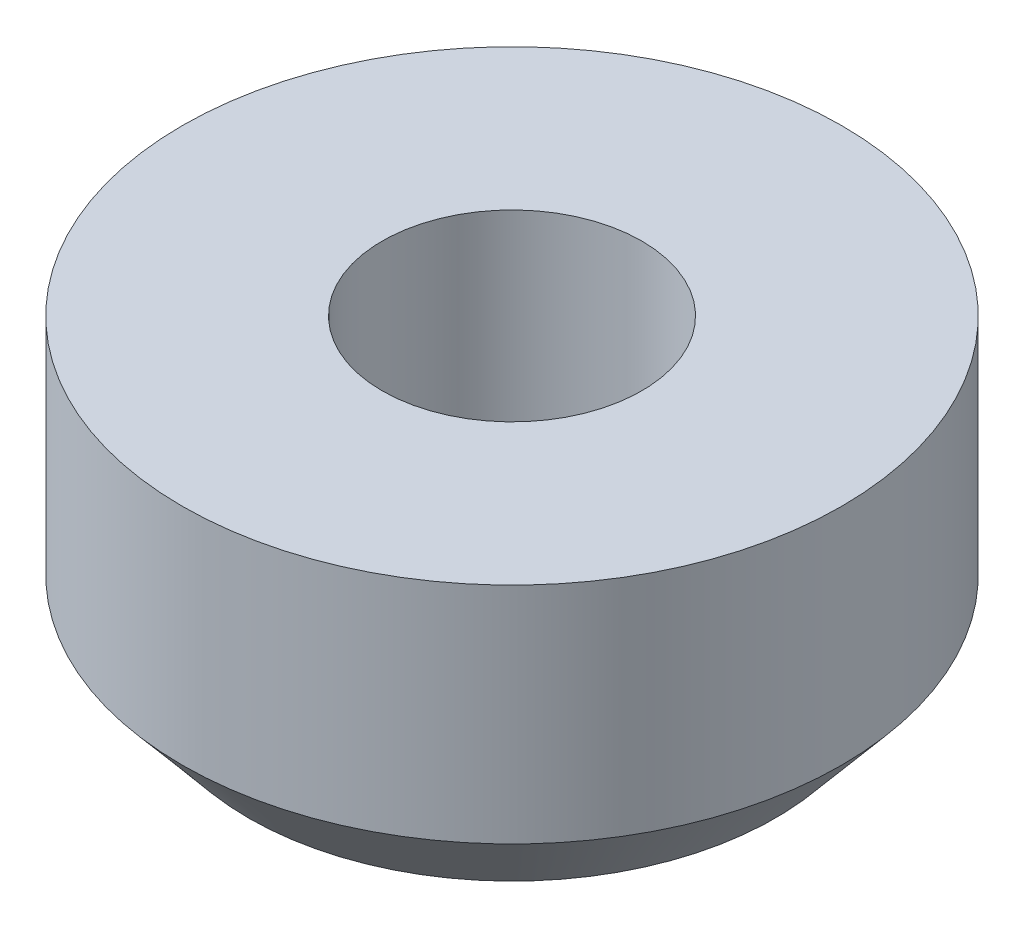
from build123d import *

# Parameters (mm, degrees)
SKETCH1_R             = 6.35
BOSS_EXTRUDE1_DEPTH   = 2.921
M6X1_0_TAPPED_HOLE1_D = 5
CHAMFER1_SIZE         = 1.524
CHAMFER1_SIZE2        = 1.278787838


with BuildPart() as part:
    # Sketch1 → Boss-Extrude1 (new, symmetric)
    with BuildSketch(Plane(origin=(0, 0, 0), x_dir=(1, 0, 0), z_dir=(0, 1, 0))):
        with Locations(Location((0, 0, 0), (0, 0, 270))):
            Circle(SKETCH1_R)
    extrude(amount=BOSS_EXTRUDE1_DEPTH, both=True)

    # M6x1.0 Tapped Hole1 (through all)
    with Locations(Plane.XZ.offset(2.921)):
        with Locations((0, 0)):
            Hole(M6X1_0_TAPPED_HOLE1_D / 2)

    # Chamfer1
    chamfer1_edges = [part.edges().sort_by_distance(p)[0] for p in [
        (0, -2.921, -6.35),
    ]]
    chamfer1_side = [part.faces().sort_by_distance(p)[0] for p in [
        (0, 0, -6.35),
    ]]
    chamfer(chamfer1_edges, length=CHAMFER1_SIZE, length2=CHAMFER1_SIZE2, reference=chamfer1_side[0])


solid = part.part
